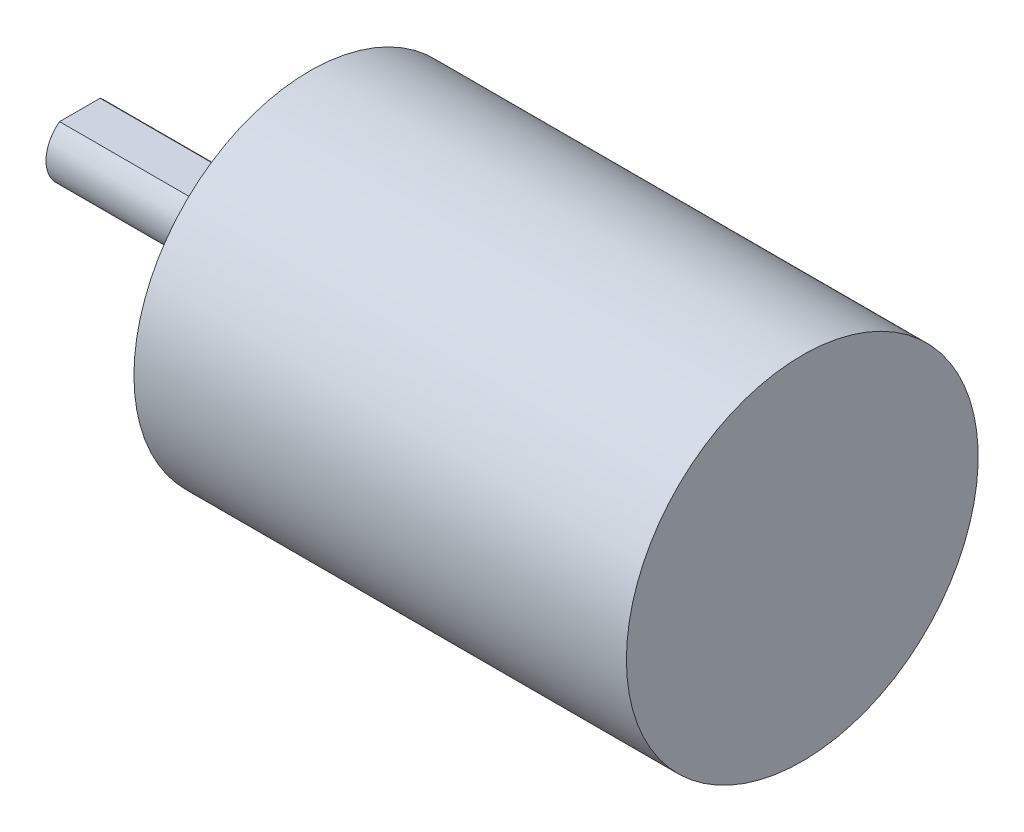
from build123d import *

# Parameters (mm, degrees)
ENL_V_START                  = -12
ENL_V_MAT_EXTRU_1_DEPTH      = 12
R_P_TITION_CIRCULAIRE1_COUNT = 4


with BuildPart() as part:
    # Esquisse1 → R_volution1 (revolve)
    with BuildSketch(Plane.XY, mode=Mode.PRIVATE) as r_volution1_sk:
        Polygon((0, 0), (0, 2.5), (14.5, 2.5), (14.5, 3), (15, 3), (15, 6.5), (17, 6.5), (17, 13), (53.4, 13), (53.4, 0), align=None)
    revolve(r_volution1_sk.sketch.rotate(Axis((0, 0, 0), (1, 0, 0)), 90), axis=Axis((0, 0, 0), (1, 0, 0)))

    # Esquisse2 → Enl_v. mat.-Extru.1 (cut)
    with BuildSketch(Plane.ZY.offset(ENL_V_START)):
        with BuildLine():
            Line((-1.5, 2), (1.5, 2))
            ThreePointArc((1.5, 2), (0, 2.5), (-1.5, 2))
        make_face()
    extrude(amount=ENL_V_MAT_EXTRU_1_DEPTH, mode=Mode.SUBTRACT)

    # Esquisse3 → Trou taraud_ M3x0.51 (revolve, cut)
    with BuildSketch(Plane(origin=(17, 0, 10), x_dir=(0, 0, 1), z_dir=(0, 1, 0))):
        Polygon((0, 0), (0, 6.221687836), (1.25, 5.5), (1.25, 0.25), (1.5, 0), align=None)
    trou_taraud_m3x0_51 = revolve(axis=Axis((10.65, 0, 10), (1, 0, 0)), mode=Mode.SUBTRACT)

    # R_p_tition circulaire1: Trou taraud_ M3x0.51 ×4 about axis
    r_p_tition_circulaire1_axis = Axis((0, 0, 0), (1, 0, 0))
    for i in range(1, R_P_TITION_CIRCULAIRE1_COUNT):
        add(trou_taraud_m3x0_51.rotate(r_p_tition_circulaire1_axis, i * 360 / R_P_TITION_CIRCULAIRE1_COUNT), mode=Mode.SUBTRACT)


solid = part.part
